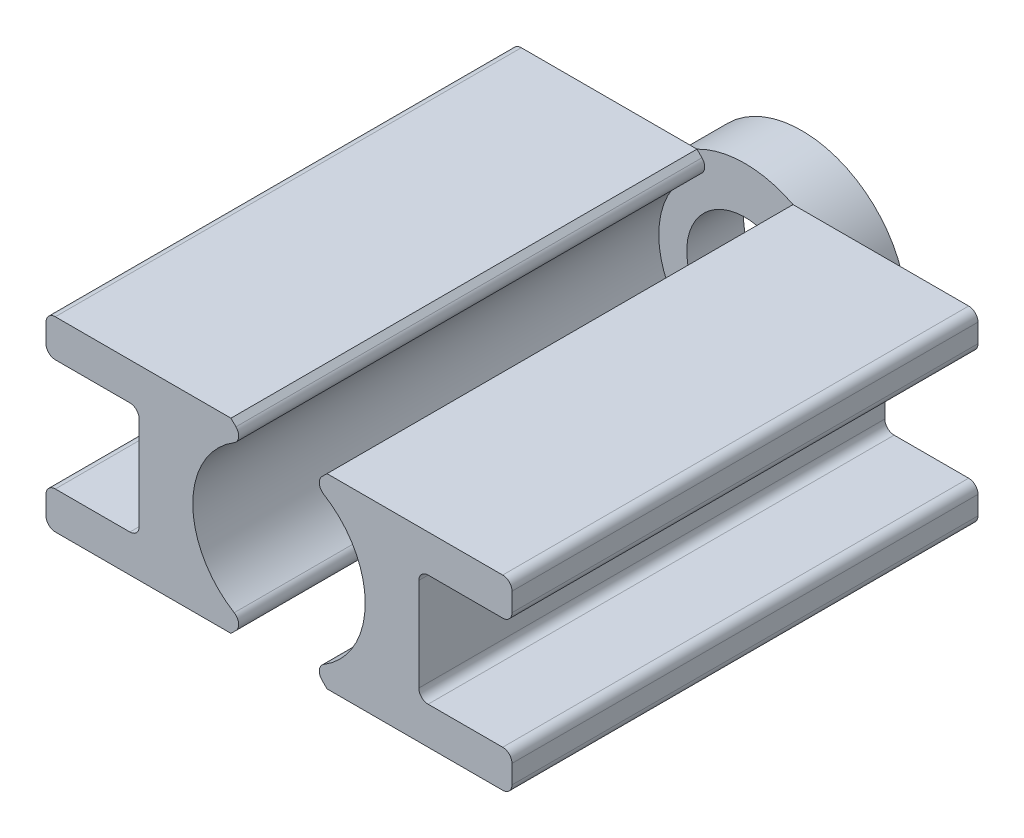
from build123d import *

# Parameters (mm, degrees)
SKETCH1_R           = 22.5
SKETCH1_R_2         = 12.5
BOSS_EXTRUDE1_DEPTH = 12.2
BOSS_EXTRUDE2_DEPTH = 100


with BuildPart() as part:
    # Sketch1 → Boss-Extrude1 (new body)
    with BuildSketch(Plane.XY):
        Circle(SKETCH1_R)
        Circle(SKETCH1_R_2, mode=Mode.SUBTRACT)
    extrude(amount=BOSS_EXTRUDE1_DEPTH)

    # Sketch2 → Boss-Extrude2 (add)
    with BuildSketch(Plane.XY.offset(12.2)):
        with BuildLine():
            Line((-48, 20), (-10.307764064, 20))
            Line((-10.307764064, 20), (-9.237455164, 18.929691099))
            ThreePointArc((-9.237455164, 18.929691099), (-8.665934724, 17.277023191), (-9.612481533, 15.80665046))
            ThreePointArc((-9.612481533, 15.80665046), (-18.5, 0), (-9.612481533, -15.80665046))
            ThreePointArc((-9.612481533, -15.80665046), (-8.665934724, -17.277023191), (-9.237455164, -18.929691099))
            Line((-9.237455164, -18.929691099), (-10.307764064, -20))
            Line((-10.307764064, -20), (-48, -20))
            ThreePointArc((-48, -20), (-49.414213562, -19.414213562), (-50, -18))
            Line((-50, -18), (-50, -14))
            ThreePointArc((-50, -14), (-49.414213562, -12.585786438), (-48, -12))
            Line((-48, -12), (-32, -12))
            ThreePointArc((-32, -12), (-30.585786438, -11.414213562), (-30, -10))
            Line((-30, -10), (-30, 10))
            ThreePointArc((-30, 10), (-30.585786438, 11.414213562), (-32, 12))
            Line((-32, 12), (-48, 12))
            ThreePointArc((-48, 12), (-49.414213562, 12.585786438), (-50, 14))
            Line((-50, 14), (-50, 18))
            ThreePointArc((-50, 18), (-49.414213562, 19.414213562), (-48, 20))
        make_face()
        with BuildLine():
            Line((48, 20), (10.307764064, 20))
            Line((10.307764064, 20), (9.237455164, 18.929691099))
            ThreePointArc((9.237455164, 18.929691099), (8.665934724, 17.277023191), (9.612481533, 15.80665046))
            ThreePointArc((9.612481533, 15.80665046), (18.5, 0), (9.612481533, -15.80665046))
            ThreePointArc((9.612481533, -15.80665046), (8.665934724, -17.277023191), (9.237455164, -18.929691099))
            Line((9.237455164, -18.929691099), (10.307764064, -20))
            Line((10.307764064, -20), (48, -20))
            ThreePointArc((48, -20), (49.414213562, -19.414213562), (50, -18))
            Line((50, -18), (50, -14))
            ThreePointArc((50, -14), (49.414213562, -12.585786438), (48, -12))
            Line((48, -12), (32, -12))
            ThreePointArc((32, -12), (30.585786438, -11.414213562), (30, -10))
            Line((30, -10), (30, 10))
            ThreePointArc((30, 10), (30.585786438, 11.414213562), (32, 12))
            Line((32, 12), (48, 12))
            ThreePointArc((48, 12), (49.414213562, 12.585786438), (50, 14))
            Line((50, 14), (50, 18))
            ThreePointArc((50, 18), (49.414213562, 19.414213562), (48, 20))
        make_face()
    extrude(amount=BOSS_EXTRUDE2_DEPTH)


solid = part.part
